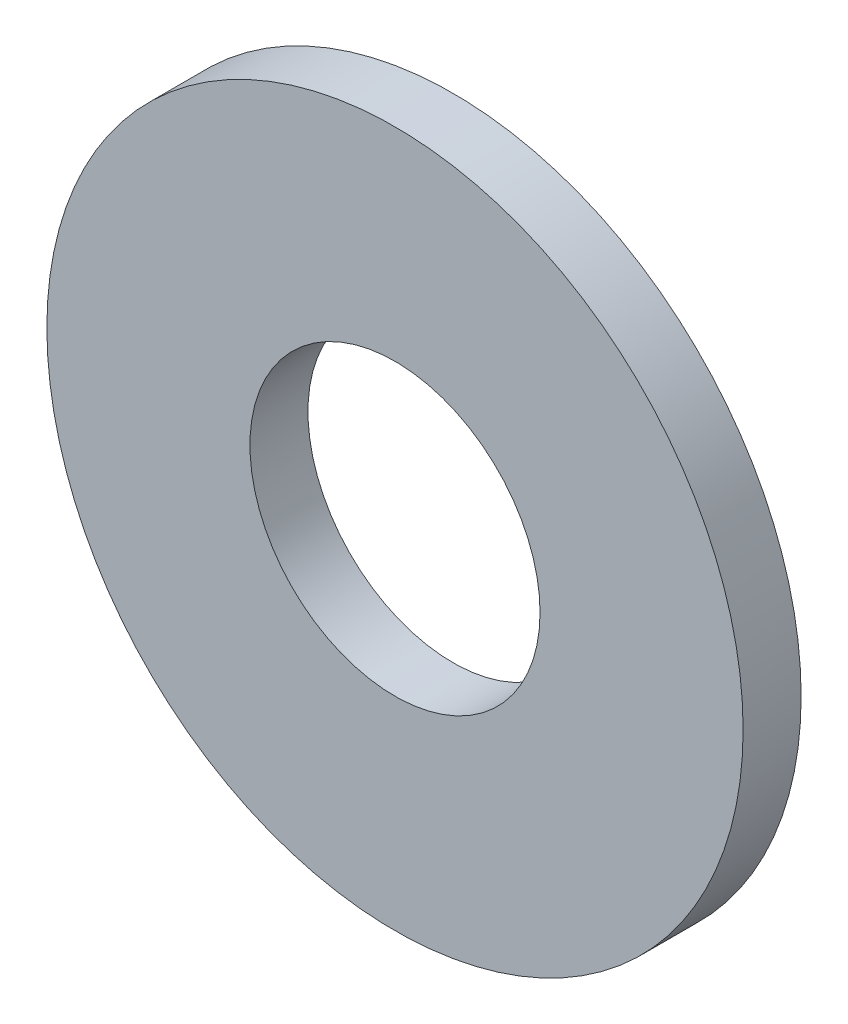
from build123d import *

# Parameters (mm, degrees)
ANILLO_PROFILE_R  = 12
TALADRO_PROFILE_R = 5


with BuildPart() as part:
    # Anillo: sweep along a curve in space
    with BuildLine() as anillo_path:
        Line((-425.1, 65, 58), (-425.1, 65, 60))
    # Anillo profile (on start of the path) → Anillo (sweep)
    with BuildSketch(Plane(origin=(-425.1, 65, 58), x_dir=(1, 0, 0), z_dir=(0, 0, 1))):
        Circle(ANILLO_PROFILE_R)
    sweep(path=anillo_path.line)

    # Taladro: sweep along a curve in space
    with BuildLine() as taladro_path:
        Line((-425.1, 65, 58), (-425.1, 65, 60))
    # Taladro profile (on start of the path) → Taladro (sweep, cut)
    with BuildSketch(Plane(origin=(-425.1, 65, 58), x_dir=(1, 0, 0), z_dir=(0, 0, 1))):
        Circle(TALADRO_PROFILE_R)
    sweep(path=taladro_path.line, mode=Mode.SUBTRACT)


solid = part.part
